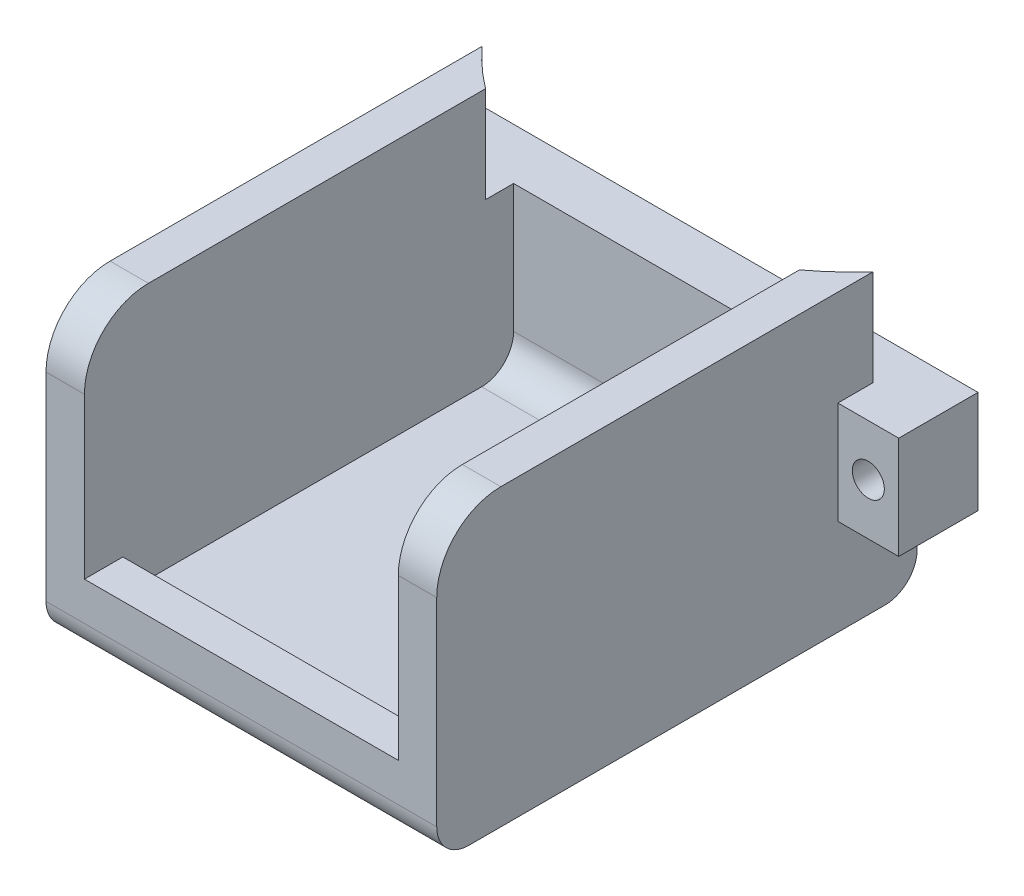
ISO-10303-21;
HEADER;
FILE_DESCRIPTION(('STEP AP214'),'2;1');
FILE_NAME('part.step','',(''),(''),'','','');
FILE_SCHEMA(('AUTOMOTIVE_DESIGN { 1 0 10303 214 1 1 1 1 }'));
ENDSEC;
DATA;
#1=APPLICATION_CONTEXT('core data for automotive mechanical design processes');
#2=APPLICATION_PROTOCOL_DEFINITION('international standard','automotive_design',2000,#1);
#3=PRODUCT_CONTEXT('',#1,'mechanical');
#4=PRODUCT('Part','Part','',(#3));
#5=PRODUCT_RELATED_PRODUCT_CATEGORY('part','',(#4));
#6=PRODUCT_DEFINITION_FORMATION('','',#4);
#7=PRODUCT_DEFINITION_CONTEXT('part definition',#1,'design');
#8=PRODUCT_DEFINITION('design','',#6,#7);
#9=PRODUCT_DEFINITION_SHAPE('','',#8);
#10=(LENGTH_UNIT() NAMED_UNIT(*) SI_UNIT(.MILLI.,.METRE.));
#11=(NAMED_UNIT(*) PLANE_ANGLE_UNIT() SI_UNIT($,.RADIAN.));
#12=(NAMED_UNIT(*) SI_UNIT($,.STERADIAN.) SOLID_ANGLE_UNIT());
#13=UNCERTAINTY_MEASURE_WITH_UNIT(LENGTH_MEASURE(1.E-05),#10,'distance_accuracy_value','');
#14=(GEOMETRIC_REPRESENTATION_CONTEXT(3) GLOBAL_UNCERTAINTY_ASSIGNED_CONTEXT((#13)) GLOBAL_UNIT_ASSIGNED_CONTEXT((#10,
#11,#12)) REPRESENTATION_CONTEXT('',''));
#15=CARTESIAN_POINT('',(0.,0.,0.));
#16=DIRECTION('',(0.,0.,1.));
#17=DIRECTION('',(1.,0.,0.));
#18=AXIS2_PLACEMENT_3D('',#15,#16,#17);
#19=CARTESIAN_POINT('',(0.,0.,0.));
#20=DIRECTION('',(0.,1.,0.));
#21=DIRECTION('',(0.,0.,1.));
#22=AXIS2_PLACEMENT_3D('',#19,#20,#21);
#23=PLANE('',#22);
#24=DIRECTION('',(0.,0.,-1.));
#25=VECTOR('',#24,1.);
#26=CARTESIAN_POINT('',(-40.,0.,0.));
#27=LINE('',#26,#25);
#28=CARTESIAN_POINT('',(-40.,0.,32.8747623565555));
#29=VERTEX_POINT('',#28);
#30=CARTESIAN_POINT('',(-40.,0.,20.5));
#31=VERTEX_POINT('',#30);
#32=EDGE_CURVE('E237',#29,#31,#27,.T.);
#33=ORIENTED_EDGE('',*,*,#32,.T.);
#34=DIRECTION('',(1.,0.,0.));
#35=VECTOR('',#34,1.);
#36=CARTESIAN_POINT('',(0.,0.,20.5));
#37=LINE('',#36,#35);
#38=CARTESIAN_POINT('',(-30.5,0.,20.5));
#39=VERTEX_POINT('',#38);
#40=EDGE_CURVE('E49',#31,#39,#37,.T.);
#41=ORIENTED_EDGE('',*,*,#40,.T.);
#42=DIRECTION('',(0.,0.,1.));
#43=VECTOR('',#42,1.);
#44=CARTESIAN_POINT('',(-30.5,0.,0.));
#45=LINE('',#44,#43);
#46=CARTESIAN_POINT('',(-30.5,0.,32.8747623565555));
#47=VERTEX_POINT('',#46);
#48=EDGE_CURVE('E320',#39,#47,#45,.T.);
#49=ORIENTED_EDGE('',*,*,#48,.T.);
#50=DIRECTION('',(-1.,0.,0.));
#51=VECTOR('',#50,1.);
#52=CARTESIAN_POINT('',(-24.5,0.,32.8747623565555));
#53=LINE('',#52,#51);
#54=EDGE_CURVE('E395',#47,#29,#53,.T.);
#55=ORIENTED_EDGE('',*,*,#54,.T.);
#56=EDGE_LOOP('',(#33,#41,#49,#55));
#57=FACE_BOUND('',#56,.T.);
#58=ADVANCED_FACE('F33',(#57),#23,.F.);
#59=CARTESIAN_POINT('',(30.5,31.,95.5));
#60=DIRECTION('',(1.,0.,0.));
#61=DIRECTION('',(0.,0.,-1.));
#62=AXIS2_PLACEMENT_3D('',#59,#60,#61);
#63=PLANE('',#62);
#64=DIRECTION('',(0.,-1.,0.));
#65=VECTOR('',#64,1.);
#66=CARTESIAN_POINT('',(30.5,31.,32.8747623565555));
#67=LINE('',#66,#65);
#68=CARTESIAN_POINT('',(30.5,16.,32.8747623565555));
#69=VERTEX_POINT('',#68);
#70=CARTESIAN_POINT('',(30.5,0.,32.8747623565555));
#71=VERTEX_POINT('',#70);
#72=EDGE_CURVE('E246',#69,#71,#67,.T.);
#73=ORIENTED_EDGE('',*,*,#72,.F.);
#74=DIRECTION('',(0.,0.,-1.));
#75=VECTOR('',#74,1.);
#76=CARTESIAN_POINT('',(30.5,16.,95.5));
#77=LINE('',#76,#75);
#78=CARTESIAN_POINT('',(30.5,16.,27.3998175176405));
#79=VERTEX_POINT('',#78);
#80=EDGE_CURVE('E241',#69,#79,#77,.T.);
#81=ORIENTED_EDGE('',*,*,#80,.T.);
#82=DIRECTION('',(0.,-1.,0.));
#83=VECTOR('',#82,1.);
#84=CARTESIAN_POINT('',(30.5,31.001,27.3998175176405));
#85=LINE('',#84,#83);
#86=CARTESIAN_POINT('',(30.5,31.,27.3998175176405));
#87=VERTEX_POINT('',#86);
#88=EDGE_CURVE('E257',#87,#79,#85,.T.);
#89=ORIENTED_EDGE('',*,*,#88,.F.);
#90=DIRECTION('',(0.,0.,-1.));
#91=VECTOR('',#90,1.);
#92=CARTESIAN_POINT('',(30.5,31.,95.5));
#93=LINE('',#92,#91);
#94=CARTESIAN_POINT('',(30.5,31.,85.5));
#95=VERTEX_POINT('',#94);
#96=EDGE_CURVE('E317',#95,#87,#93,.T.);
#97=ORIENTED_EDGE('',*,*,#96,.F.);
#98=CARTESIAN_POINT('',(30.5,21.,85.5));
#99=DIRECTION('',(1.,0.,0.));
#100=DIRECTION('',(0.,0.,-1.));
#101=AXIS2_PLACEMENT_3D('',#98,#99,#100);
#102=CIRCLE('',#101,10.);
#103=CARTESIAN_POINT('',(30.5,21.,95.5));
#104=VERTEX_POINT('',#103);
#105=EDGE_CURVE('E339',#95,#104,#102,.T.);
#106=ORIENTED_EDGE('',*,*,#105,.T.);
#107=DIRECTION('',(0.,-1.,0.));
#108=VECTOR('',#107,1.);
#109=CARTESIAN_POINT('',(30.5,31.,95.5));
#110=LINE('',#109,#108);
#111=CARTESIAN_POINT('',(30.5,-9.99999999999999,95.5));
#112=VERTEX_POINT('',#111);
#113=EDGE_CURVE('E307',#104,#112,#110,.T.);
#114=ORIENTED_EDGE('',*,*,#113,.T.);
#115=CARTESIAN_POINT('',(30.5,-10.,90.5));
#116=DIRECTION('',(1.,0.,0.));
#117=DIRECTION('',(0.,0.,-1.));
#118=AXIS2_PLACEMENT_3D('',#115,#116,#117);
#119=CIRCLE('',#118,5.);
#120=CARTESIAN_POINT('',(30.5,-15.,90.5));
#121=VERTEX_POINT('',#120);
#122=EDGE_CURVE('E379',#112,#121,#119,.T.);
#123=ORIENTED_EDGE('',*,*,#122,.T.);
#124=DIRECTION('',(0.,0.,-1.));
#125=VECTOR('',#124,1.);
#126=CARTESIAN_POINT('',(30.5,-15.,95.5));
#127=LINE('',#126,#125);
#128=CARTESIAN_POINT('',(30.5,-15.,25.5));
#129=VERTEX_POINT('',#128);
#130=EDGE_CURVE('E313',#121,#129,#127,.T.);
#131=ORIENTED_EDGE('',*,*,#130,.T.);
#132=CARTESIAN_POINT('',(30.5,-10.,25.5));
#133=DIRECTION('',(1.,0.,0.));
#134=DIRECTION('',(0.,0.,-1.));
#135=AXIS2_PLACEMENT_3D('',#132,#133,#134);
#136=CIRCLE('',#135,5.);
#137=CARTESIAN_POINT('',(30.5,-9.99999999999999,20.5));
#138=VERTEX_POINT('',#137);
#139=EDGE_CURVE('E377',#129,#138,#136,.T.);
#140=ORIENTED_EDGE('',*,*,#139,.T.);
#141=DIRECTION('',(0.,-1.,0.));
#142=VECTOR('',#141,1.);
#143=CARTESIAN_POINT('',(30.5,31.,20.5));
#144=LINE('',#143,#142);
#145=CARTESIAN_POINT('',(30.5,0.,20.5));
#146=VERTEX_POINT('',#145);
#147=EDGE_CURVE('E300',#146,#138,#144,.T.);
#148=ORIENTED_EDGE('',*,*,#147,.F.);
#149=DIRECTION('',(0.,0.,-1.));
#150=VECTOR('',#149,1.);
#151=CARTESIAN_POINT('',(30.5,0.,0.));
#152=LINE('',#151,#150);
#153=EDGE_CURVE('E330',#71,#146,#152,.T.);
#154=ORIENTED_EDGE('',*,*,#153,.F.);
#155=EDGE_LOOP('',(#73,#81,#89,#97,#106,#114,#123,#131,#140,#148,#154));
#156=FACE_BOUND('',#155,.T.);
#157=ADVANCED_FACE('F419',(#156),#63,.T.);
#158=CARTESIAN_POINT('',(-30.5,31.,95.5));
#159=DIRECTION('',(-1.,0.,0.));
#160=DIRECTION('',(0.,0.,1.));
#161=AXIS2_PLACEMENT_3D('',#158,#159,#160);
#162=PLANE('',#161);
#163=DIRECTION('',(0.,-1.,0.));
#164=VECTOR('',#163,1.);
#165=CARTESIAN_POINT('',(-30.5,31.001,27.3998175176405));
#166=LINE('',#165,#164);
#167=CARTESIAN_POINT('',(-30.5,16.,27.3998175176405));
#168=VERTEX_POINT('',#167);
#169=CARTESIAN_POINT('',(-30.5,31.,27.3998175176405));
#170=VERTEX_POINT('',#169);
#171=EDGE_CURVE('E255',#168,#170,#166,.F.);
#172=ORIENTED_EDGE('',*,*,#171,.F.);
#173=DIRECTION('',(0.,0.,1.));
#174=VECTOR('',#173,1.);
#175=CARTESIAN_POINT('',(-30.5,16.,95.5));
#176=LINE('',#175,#174);
#177=CARTESIAN_POINT('',(-30.5,16.,32.8747623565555));
#178=VERTEX_POINT('',#177);
#179=EDGE_CURVE('E239',#168,#178,#176,.T.);
#180=ORIENTED_EDGE('',*,*,#179,.T.);
#181=DIRECTION('',(0.,1.,0.));
#182=VECTOR('',#181,1.);
#183=CARTESIAN_POINT('',(-30.5,31.,32.8747623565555));
#184=LINE('',#183,#182);
#185=EDGE_CURVE('E243',#47,#178,#184,.T.);
#186=ORIENTED_EDGE('',*,*,#185,.F.);
#187=ORIENTED_EDGE('',*,*,#48,.F.);
#188=DIRECTION('',(0.,1.,0.));
#189=VECTOR('',#188,1.);
#190=CARTESIAN_POINT('',(-30.5,31.,20.5));
#191=LINE('',#190,#189);
#192=CARTESIAN_POINT('',(-30.5,-9.99999999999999,20.5));
#193=VERTEX_POINT('',#192);
#194=EDGE_CURVE('E311',#193,#39,#191,.T.);
#195=ORIENTED_EDGE('',*,*,#194,.F.);
#196=CARTESIAN_POINT('',(-30.5,-10.,25.5));
#197=DIRECTION('',(-1.,0.,0.));
#198=DIRECTION('',(0.,0.,1.));
#199=AXIS2_PLACEMENT_3D('',#196,#197,#198);
#200=CIRCLE('',#199,5.);
#201=CARTESIAN_POINT('',(-30.5,-15.,25.5));
#202=VERTEX_POINT('',#201);
#203=EDGE_CURVE('E371',#193,#202,#200,.T.);
#204=ORIENTED_EDGE('',*,*,#203,.T.);
#205=DIRECTION('',(0.,0.,-1.));
#206=VECTOR('',#205,1.);
#207=CARTESIAN_POINT('',(-30.5,-15.,95.5));
#208=LINE('',#207,#206);
#209=CARTESIAN_POINT('',(-30.5,-15.,90.5));
#210=VERTEX_POINT('',#209);
#211=EDGE_CURVE('E324',#210,#202,#208,.T.);
#212=ORIENTED_EDGE('',*,*,#211,.F.);
#213=CARTESIAN_POINT('',(-30.5,-10.,90.5));
#214=DIRECTION('',(-1.,0.,0.));
#215=DIRECTION('',(0.,0.,1.));
#216=AXIS2_PLACEMENT_3D('',#213,#214,#215);
#217=CIRCLE('',#216,5.);
#218=CARTESIAN_POINT('',(-30.5,-9.99999999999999,95.5));
#219=VERTEX_POINT('',#218);
#220=EDGE_CURVE('E373',#210,#219,#217,.T.);
#221=ORIENTED_EDGE('',*,*,#220,.T.);
#222=DIRECTION('',(0.,1.,0.));
#223=VECTOR('',#222,1.);
#224=CARTESIAN_POINT('',(-30.5,31.,95.5));
#225=LINE('',#224,#223);
#226=CARTESIAN_POINT('',(-30.5,21.,95.5));
#227=VERTEX_POINT('',#226);
#228=EDGE_CURVE('E310',#219,#227,#225,.T.);
#229=ORIENTED_EDGE('',*,*,#228,.T.);
#230=CARTESIAN_POINT('',(-30.5,21.,85.5));
#231=DIRECTION('',(-1.,0.,0.));
#232=DIRECTION('',(0.,0.,1.));
#233=AXIS2_PLACEMENT_3D('',#230,#231,#232);
#234=CIRCLE('',#233,10.);
#235=CARTESIAN_POINT('',(-30.5,31.,85.5));
#236=VERTEX_POINT('',#235);
#237=EDGE_CURVE('E350',#227,#236,#234,.T.);
#238=ORIENTED_EDGE('',*,*,#237,.T.);
#239=DIRECTION('',(0.,0.,-1.));
#240=VECTOR('',#239,1.);
#241=CARTESIAN_POINT('',(-30.5,31.,95.5));
#242=LINE('',#241,#240);
#243=EDGE_CURVE('E321',#236,#170,#242,.T.);
#244=ORIENTED_EDGE('',*,*,#243,.T.);
#245=EDGE_LOOP('',(#172,#180,#186,#187,#195,#204,#212,#221,#229,#238,#244));
#246=FACE_BOUND('',#245,.T.);
#247=ADVANCED_FACE('F390',(#246),#162,.T.);
#248=CARTESIAN_POINT('',(20.5,0.,20.5));
#249=DIRECTION('',(0.,0.,1.));
#250=DIRECTION('',(1.,0.,0.));
#251=AXIS2_PLACEMENT_3D('',#248,#249,#250);
#252=PLANE('',#251);
#253=ORIENTED_EDGE('',*,*,#194,.T.);
#254=ORIENTED_EDGE('',*,*,#40,.F.);
#255=DIRECTION('',(0.,-1.,0.));
#256=VECTOR('',#255,1.);
#257=CARTESIAN_POINT('',(-40.,31.,20.5));
#258=LINE('',#257,#256);
#259=CARTESIAN_POINT('',(-40.,16.,20.5));
#260=VERTEX_POINT('',#259);
#261=EDGE_CURVE('E208',#260,#31,#258,.T.);
#262=ORIENTED_EDGE('',*,*,#261,.F.);
#263=DIRECTION('',(1.,0.,0.));
#264=VECTOR('',#263,1.);
#265=CARTESIAN_POINT('',(0.,16.,20.5));
#266=LINE('',#265,#264);
#267=CARTESIAN_POINT('',(40.,16.,20.5));
#268=VERTEX_POINT('',#267);
#269=EDGE_CURVE('E55',#260,#268,#266,.T.);
#270=ORIENTED_EDGE('',*,*,#269,.T.);
#271=DIRECTION('',(0.,-1.,0.));
#272=VECTOR('',#271,1.);
#273=CARTESIAN_POINT('',(40.,31.,20.5));
#274=LINE('',#273,#272);
#275=CARTESIAN_POINT('',(40.,0.,20.5));
#276=VERTEX_POINT('',#275);
#277=EDGE_CURVE('E214',#268,#276,#274,.T.);
#278=ORIENTED_EDGE('',*,*,#277,.T.);
#279=EDGE_CURVE('E396',#146,#276,#37,.T.);
#280=ORIENTED_EDGE('',*,*,#279,.F.);
#281=ORIENTED_EDGE('',*,*,#147,.T.);
#282=DIRECTION('',(-1.,0.,0.));
#283=VECTOR('',#282,1.);
#284=CARTESIAN_POINT('',(-30.5,-10.,20.5));
#285=LINE('',#284,#283);
#286=EDGE_CURVE('E42',#138,#193,#285,.T.);
#287=ORIENTED_EDGE('',*,*,#286,.T.);
#288=EDGE_LOOP('',(#253,#254,#262,#270,#278,#280,#281,#287));
#289=FACE_BOUND('',#288,.T.);
#290=CARTESIAN_POINT('',(-35.25,8.,20.5));
#291=DIRECTION('',(0.,0.,1.));
#292=DIRECTION('',(1.,0.,0.));
#293=AXIS2_PLACEMENT_3D('',#290,#291,#292);
#294=CIRCLE('',#293,2.49999999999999);
#295=CARTESIAN_POINT('',(-32.75,8.,20.5));
#296=VERTEX_POINT('',#295);
#297=EDGE_CURVE('E37',#296,#296,#294,.F.);
#298=ORIENTED_EDGE('',*,*,#297,.F.);
#299=EDGE_LOOP('',(#298));
#300=FACE_BOUND('',#299,.T.);
#301=CARTESIAN_POINT('',(35.25,8.,20.5));
#302=DIRECTION('',(0.,0.,1.));
#303=DIRECTION('',(1.,0.,0.));
#304=AXIS2_PLACEMENT_3D('',#301,#302,#303);
#305=CIRCLE('',#304,2.49999999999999);
#306=CARTESIAN_POINT('',(37.75,8.,20.5));
#307=VERTEX_POINT('',#306);
#308=EDGE_CURVE('E401',#307,#307,#305,.F.);
#309=ORIENTED_EDGE('',*,*,#308,.F.);
#310=EDGE_LOOP('',(#309));
#311=FACE_BOUND('',#310,.T.);
#312=ADVANCED_FACE('F209',(#289,#300,#311),#252,.F.);
#313=CARTESIAN_POINT('',(30.5,31.,95.5));
#314=DIRECTION('',(0.,1.,0.));
#315=DIRECTION('',(0.,0.,1.));
#316=AXIS2_PLACEMENT_3D('',#313,#314,#315);
#317=PLANE('',#316);
#318=ORIENTED_EDGE('',*,*,#96,.T.);
#319=CARTESIAN_POINT('',(0.,31.,0.));
#320=DIRECTION('',(0.,1.,0.));
#321=DIRECTION('',(0.,0.,1.));
#322=AXIS2_PLACEMENT_3D('',#319,#320,#321);
#323=CIRCLE('',#322,41.);
#324=CARTESIAN_POINT('',(24.5,31.,32.8747623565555));
#325=VERTEX_POINT('',#324);
#326=EDGE_CURVE('E273',#325,#87,#323,.T.);
#327=ORIENTED_EDGE('',*,*,#326,.F.);
#328=DIRECTION('',(0.,0.,-1.));
#329=VECTOR('',#328,1.);
#330=CARTESIAN_POINT('',(24.5,31.,95.5));
#331=LINE('',#330,#329);
#332=CARTESIAN_POINT('',(24.5,31.,85.5));
#333=VERTEX_POINT('',#332);
#334=EDGE_CURVE('E281',#333,#325,#331,.T.);
#335=ORIENTED_EDGE('',*,*,#334,.F.);
#336=DIRECTION('',(1.,0.,0.));
#337=VECTOR('',#336,1.);
#338=CARTESIAN_POINT('',(30.5,31.,85.5));
#339=LINE('',#338,#337);
#340=EDGE_CURVE('E336',#333,#95,#339,.T.);
#341=ORIENTED_EDGE('',*,*,#340,.T.);
#342=EDGE_LOOP('',(#318,#327,#335,#341));
#343=FACE_BOUND('',#342,.T.);
#344=ADVANCED_FACE('F448',(#343),#317,.T.);
#345=DIRECTION('',(0.,0.,1.));
#346=VECTOR('',#345,1.);
#347=CARTESIAN_POINT('',(-24.5,31.,95.5));
#348=LINE('',#347,#346);
#349=CARTESIAN_POINT('',(-24.5,31.,32.8747623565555));
#350=VERTEX_POINT('',#349);
#351=CARTESIAN_POINT('',(-24.5,31.,85.5));
#352=VERTEX_POINT('',#351);
#353=EDGE_CURVE('E288',#350,#352,#348,.T.);
#354=ORIENTED_EDGE('',*,*,#353,.F.);
#355=EDGE_CURVE('E205',#170,#350,#323,.T.);
#356=ORIENTED_EDGE('',*,*,#355,.F.);
#357=ORIENTED_EDGE('',*,*,#243,.F.);
#358=DIRECTION('',(1.,0.,0.));
#359=VECTOR('',#358,1.);
#360=CARTESIAN_POINT('',(-24.5,31.,85.5));
#361=LINE('',#360,#359);
#362=EDGE_CURVE('E333',#236,#352,#361,.T.);
#363=ORIENTED_EDGE('',*,*,#362,.T.);
#364=EDGE_LOOP('',(#354,#356,#357,#363));
#365=FACE_BOUND('',#364,.T.);
#366=ADVANCED_FACE('F485',(#365),#317,.T.);
#367=CARTESIAN_POINT('',(24.5,-4.,95.5));
#368=DIRECTION('',(1.,0.,0.));
#369=DIRECTION('',(0.,0.,-1.));
#370=AXIS2_PLACEMENT_3D('',#367,#368,#369);
#371=PLANE('',#370);
#372=DIRECTION('',(0.,-1.,0.));
#373=VECTOR('',#372,1.);
#374=CARTESIAN_POINT('',(24.5,31.001,32.8747623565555));
#375=LINE('',#374,#373);
#376=CARTESIAN_POINT('',(24.5,16.,32.8747623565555));
#377=VERTEX_POINT('',#376);
#378=EDGE_CURVE('E252',#325,#377,#375,.T.);
#379=ORIENTED_EDGE('',*,*,#378,.T.);
#380=DIRECTION('',(0.,0.,-1.));
#381=VECTOR('',#380,1.);
#382=CARTESIAN_POINT('',(24.5,16.,0.));
#383=LINE('',#382,#381);
#384=CARTESIAN_POINT('',(24.5,16.,28.5));
#385=VERTEX_POINT('',#384);
#386=EDGE_CURVE('E206',#377,#385,#383,.T.);
#387=ORIENTED_EDGE('',*,*,#386,.T.);
#388=DIRECTION('',(0.,1.,0.));
#389=VECTOR('',#388,1.);
#390=CARTESIAN_POINT('',(24.5,-4.,28.5));
#391=LINE('',#390,#389);
#392=CARTESIAN_POINT('',(24.5,-4.,28.5));
#393=VERTEX_POINT('',#392);
#394=EDGE_CURVE('E293',#393,#385,#391,.T.);
#395=ORIENTED_EDGE('',*,*,#394,.F.);
#396=CARTESIAN_POINT('',(24.5,-4.,33.5));
#397=DIRECTION('',(1.,0.,0.));
#398=DIRECTION('',(0.,0.,-1.));
#399=AXIS2_PLACEMENT_3D('',#396,#397,#398);
#400=CIRCLE('',#399,5.);
#401=CARTESIAN_POINT('',(24.5,-9.00000000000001,33.5));
#402=VERTEX_POINT('',#401);
#403=EDGE_CURVE('E358',#393,#402,#400,.F.);
#404=ORIENTED_EDGE('',*,*,#403,.T.);
#405=DIRECTION('',(0.,0.,-1.));
#406=VECTOR('',#405,1.);
#407=CARTESIAN_POINT('',(24.5,-9.00000000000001,28.5));
#408=LINE('',#407,#406);
#409=CARTESIAN_POINT('',(24.5,-9.00000000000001,84.5));
#410=VERTEX_POINT('',#409);
#411=EDGE_CURVE('E277',#410,#402,#408,.T.);
#412=ORIENTED_EDGE('',*,*,#411,.F.);
#413=CARTESIAN_POINT('',(24.5,-4.,84.5));
#414=DIRECTION('',(1.,0.,0.));
#415=DIRECTION('',(0.,0.,-1.));
#416=AXIS2_PLACEMENT_3D('',#413,#414,#415);
#417=CIRCLE('',#416,5.);
#418=CARTESIAN_POINT('',(24.5,-4.,89.5));
#419=VERTEX_POINT('',#418);
#420=EDGE_CURVE('E360',#410,#419,#417,.F.);
#421=ORIENTED_EDGE('',*,*,#420,.T.);
#422=DIRECTION('',(0.,0.,-1.));
#423=VECTOR('',#422,1.);
#424=CARTESIAN_POINT('',(24.5,-4.,95.5));
#425=LINE('',#424,#423);
#426=CARTESIAN_POINT('',(24.5,-4.,95.5));
#427=VERTEX_POINT('',#426);
#428=EDGE_CURVE('E284',#427,#419,#425,.T.);
#429=ORIENTED_EDGE('',*,*,#428,.F.);
#430=DIRECTION('',(0.,1.,0.));
#431=VECTOR('',#430,1.);
#432=CARTESIAN_POINT('',(24.5,-4.,95.5));
#433=LINE('',#432,#431);
#434=CARTESIAN_POINT('',(24.5,21.,95.5));
#435=VERTEX_POINT('',#434);
#436=EDGE_CURVE('E297',#427,#435,#433,.T.);
#437=ORIENTED_EDGE('',*,*,#436,.T.);
#438=CARTESIAN_POINT('',(24.5,21.,85.5));
#439=DIRECTION('',(1.,0.,0.));
#440=DIRECTION('',(0.,0.,-1.));
#441=AXIS2_PLACEMENT_3D('',#438,#439,#440);
#442=CIRCLE('',#441,10.);
#443=EDGE_CURVE('E346',#435,#333,#442,.F.);
#444=ORIENTED_EDGE('',*,*,#443,.T.);
#445=ORIENTED_EDGE('',*,*,#334,.T.);
#446=EDGE_LOOP('',(#379,#387,#395,#404,#412,#421,#429,#437,#444,#445));
#447=FACE_BOUND('',#446,.T.);
#448=ADVANCED_FACE('F445',(#447),#371,.F.);
#449=CARTESIAN_POINT('',(-24.5,-4.,95.5));
#450=DIRECTION('',(-1.,0.,0.));
#451=DIRECTION('',(0.,0.,1.));
#452=AXIS2_PLACEMENT_3D('',#449,#450,#451);
#453=PLANE('',#452);
#454=DIRECTION('',(0.,0.,1.));
#455=VECTOR('',#454,1.);
#456=CARTESIAN_POINT('',(-24.5,16.,0.));
#457=LINE('',#456,#455);
#458=CARTESIAN_POINT('',(-24.5,16.,28.5));
#459=VERTEX_POINT('',#458);
#460=CARTESIAN_POINT('',(-24.5,16.,32.8747623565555));
#461=VERTEX_POINT('',#460);
#462=EDGE_CURVE('E267',#459,#461,#457,.T.);
#463=ORIENTED_EDGE('',*,*,#462,.T.);
#464=DIRECTION('',(0.,-1.,0.));
#465=VECTOR('',#464,1.);
#466=CARTESIAN_POINT('',(-24.5,31.001,32.8747623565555));
#467=LINE('',#466,#465);
#468=EDGE_CURVE('E249',#461,#350,#467,.F.);
#469=ORIENTED_EDGE('',*,*,#468,.T.);
#470=ORIENTED_EDGE('',*,*,#353,.T.);
#471=CARTESIAN_POINT('',(-24.5,21.,85.5));
#472=DIRECTION('',(-1.,0.,0.));
#473=DIRECTION('',(0.,0.,1.));
#474=AXIS2_PLACEMENT_3D('',#471,#472,#473);
#475=CIRCLE('',#474,10.);
#476=CARTESIAN_POINT('',(-24.5,21.,95.5));
#477=VERTEX_POINT('',#476);
#478=EDGE_CURVE('E348',#352,#477,#475,.F.);
#479=ORIENTED_EDGE('',*,*,#478,.T.);
#480=DIRECTION('',(0.,1.,0.));
#481=VECTOR('',#480,1.);
#482=CARTESIAN_POINT('',(-24.5,-4.,95.5));
#483=LINE('',#482,#481);
#484=CARTESIAN_POINT('',(-24.5,-4.,95.5));
#485=VERTEX_POINT('',#484);
#486=EDGE_CURVE('E301',#485,#477,#483,.T.);
#487=ORIENTED_EDGE('',*,*,#486,.F.);
#488=DIRECTION('',(0.,0.,1.));
#489=VECTOR('',#488,1.);
#490=CARTESIAN_POINT('',(-24.5,-4.,95.5));
#491=LINE('',#490,#489);
#492=CARTESIAN_POINT('',(-24.5,-4.,89.5));
#493=VERTEX_POINT('',#492);
#494=EDGE_CURVE('E287',#493,#485,#491,.T.);
#495=ORIENTED_EDGE('',*,*,#494,.F.);
#496=CARTESIAN_POINT('',(-24.5,-4.,84.5));
#497=DIRECTION('',(-1.,0.,0.));
#498=DIRECTION('',(0.,0.,1.));
#499=AXIS2_PLACEMENT_3D('',#496,#497,#498);
#500=CIRCLE('',#499,5.);
#501=CARTESIAN_POINT('',(-24.5,-9.00000000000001,84.5));
#502=VERTEX_POINT('',#501);
#503=EDGE_CURVE('E364',#493,#502,#500,.F.);
#504=ORIENTED_EDGE('',*,*,#503,.T.);
#505=DIRECTION('',(0.,0.,1.));
#506=VECTOR('',#505,1.);
#507=CARTESIAN_POINT('',(-24.5,-9.00000000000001,28.5));
#508=LINE('',#507,#506);
#509=CARTESIAN_POINT('',(-24.5,-9.00000000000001,33.5));
#510=VERTEX_POINT('',#509);
#511=EDGE_CURVE('E274',#510,#502,#508,.T.);
#512=ORIENTED_EDGE('',*,*,#511,.F.);
#513=CARTESIAN_POINT('',(-24.5,-4.,33.5));
#514=DIRECTION('',(-1.,0.,0.));
#515=DIRECTION('',(0.,0.,1.));
#516=AXIS2_PLACEMENT_3D('',#513,#514,#515);
#517=CIRCLE('',#516,5.);
#518=CARTESIAN_POINT('',(-24.5,-4.,28.5));
#519=VERTEX_POINT('',#518);
#520=EDGE_CURVE('E362',#510,#519,#517,.F.);
#521=ORIENTED_EDGE('',*,*,#520,.T.);
#522=DIRECTION('',(0.,1.,0.));
#523=VECTOR('',#522,1.);
#524=CARTESIAN_POINT('',(-24.5,-4.,28.5));
#525=LINE('',#524,#523);
#526=EDGE_CURVE('E304',#519,#459,#525,.T.);
#527=ORIENTED_EDGE('',*,*,#526,.T.);
#528=EDGE_LOOP('',(#463,#469,#470,#479,#487,#495,#504,#512,#521,#527));
#529=FACE_BOUND('',#528,.T.);
#530=ADVANCED_FACE('F467',(#529),#453,.F.);
#531=CARTESIAN_POINT('',(24.5,-4.,28.5));
#532=DIRECTION('',(0.,0.,-1.));
#533=DIRECTION('',(-1.,0.,0.));
#534=AXIS2_PLACEMENT_3D('',#531,#532,#533);
#535=PLANE('',#534);
#536=DIRECTION('',(-1.,0.,0.));
#537=VECTOR('',#536,1.);
#538=CARTESIAN_POINT('',(0.,16.,28.5));
#539=LINE('',#538,#537);
#540=EDGE_CURVE('E264',#385,#459,#539,.T.);
#541=ORIENTED_EDGE('',*,*,#540,.T.);
#542=ORIENTED_EDGE('',*,*,#526,.F.);
#543=DIRECTION('',(-1.,0.,0.));
#544=VECTOR('',#543,1.);
#545=CARTESIAN_POINT('',(24.5,-4.,28.5));
#546=LINE('',#545,#544);
#547=EDGE_CURVE('E11',#519,#393,#546,.F.);
#548=ORIENTED_EDGE('',*,*,#547,.T.);
#549=ORIENTED_EDGE('',*,*,#394,.T.);
#550=EDGE_LOOP('',(#541,#542,#548,#549));
#551=FACE_BOUND('',#550,.T.);
#552=ADVANCED_FACE('F491',(#551),#535,.F.);
#553=CARTESIAN_POINT('',(0.,16.,0.));
#554=DIRECTION('',(0.,1.,0.));
#555=DIRECTION('',(0.,0.,1.));
#556=AXIS2_PLACEMENT_3D('',#553,#554,#555);
#557=PLANE('',#556);
#558=ORIENTED_EDGE('',*,*,#269,.F.);
#559=DIRECTION('',(0.,0.,1.));
#560=VECTOR('',#559,1.);
#561=CARTESIAN_POINT('',(-40.,16.,0.));
#562=LINE('',#561,#560);
#563=CARTESIAN_POINT('',(-40.,16.,32.8747623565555));
#564=VERTEX_POINT('',#563);
#565=EDGE_CURVE('E201',#260,#564,#562,.T.);
#566=ORIENTED_EDGE('',*,*,#565,.T.);
#567=DIRECTION('',(1.,0.,0.));
#568=VECTOR('',#567,1.);
#569=CARTESIAN_POINT('',(-24.5,16.,32.8747623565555));
#570=LINE('',#569,#568);
#571=EDGE_CURVE('E220',#564,#178,#570,.T.);
#572=ORIENTED_EDGE('',*,*,#571,.T.);
#573=ORIENTED_EDGE('',*,*,#179,.F.);
#574=CARTESIAN_POINT('',(0.,16.,0.));
#575=DIRECTION('',(0.,1.,0.));
#576=DIRECTION('',(0.,0.,1.));
#577=AXIS2_PLACEMENT_3D('',#574,#575,#576);
#578=CIRCLE('',#577,41.);
#579=EDGE_CURVE('E260',#168,#461,#578,.T.);
#580=ORIENTED_EDGE('',*,*,#579,.T.);
#581=ORIENTED_EDGE('',*,*,#462,.F.);
#582=ORIENTED_EDGE('',*,*,#540,.F.);
#583=ORIENTED_EDGE('',*,*,#386,.F.);
#584=EDGE_CURVE('E261',#377,#79,#578,.T.);
#585=ORIENTED_EDGE('',*,*,#584,.T.);
#586=ORIENTED_EDGE('',*,*,#80,.F.);
#587=DIRECTION('',(1.,0.,0.));
#588=VECTOR('',#587,1.);
#589=CARTESIAN_POINT('',(40.,16.,32.8747623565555));
#590=LINE('',#589,#588);
#591=CARTESIAN_POINT('',(40.,16.,32.8747623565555));
#592=VERTEX_POINT('',#591);
#593=EDGE_CURVE('E223',#69,#592,#590,.T.);
#594=ORIENTED_EDGE('',*,*,#593,.T.);
#595=DIRECTION('',(0.,0.,-1.));
#596=VECTOR('',#595,1.);
#597=CARTESIAN_POINT('',(40.,16.,0.));
#598=LINE('',#597,#596);
#599=EDGE_CURVE('E204',#592,#268,#598,.T.);
#600=ORIENTED_EDGE('',*,*,#599,.T.);
#601=EDGE_LOOP('',(#558,#566,#572,#573,#580,#581,#582,#583,#585,#586,#594,#600));
#602=FACE_BOUND('',#601,.T.);
#603=ADVANCED_FACE('F198',(#602),#557,.T.);
#604=ORIENTED_EDGE('',*,*,#153,.T.);
#605=ORIENTED_EDGE('',*,*,#279,.T.);
#606=DIRECTION('',(0.,0.,1.));
#607=VECTOR('',#606,1.);
#608=CARTESIAN_POINT('',(40.,0.,0.));
#609=LINE('',#608,#607);
#610=CARTESIAN_POINT('',(40.,0.,32.8747623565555));
#611=VERTEX_POINT('',#610);
#612=EDGE_CURVE('E229',#276,#611,#609,.T.);
#613=ORIENTED_EDGE('',*,*,#612,.T.);
#614=DIRECTION('',(-1.,0.,0.));
#615=VECTOR('',#614,1.);
#616=CARTESIAN_POINT('',(40.,0.,32.8747623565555));
#617=LINE('',#616,#615);
#618=EDGE_CURVE('E405',#611,#71,#617,.T.);
#619=ORIENTED_EDGE('',*,*,#618,.T.);
#620=EDGE_LOOP('',(#604,#605,#613,#619));
#621=FACE_BOUND('',#620,.T.);
#622=ADVANCED_FACE('F410',(#621),#23,.F.);
#623=CARTESIAN_POINT('',(30.5,-15.,95.5));
#624=DIRECTION('',(0.,-1.,0.));
#625=DIRECTION('',(0.,0.,-1.));
#626=AXIS2_PLACEMENT_3D('',#623,#624,#625);
#627=PLANE('',#626);
#628=ORIENTED_EDGE('',*,*,#130,.F.);
#629=DIRECTION('',(-1.,0.,0.));
#630=VECTOR('',#629,1.);
#631=CARTESIAN_POINT('',(-30.5,-15.,90.5));
#632=LINE('',#631,#630);
#633=EDGE_CURVE('E368',#121,#210,#632,.T.);
#634=ORIENTED_EDGE('',*,*,#633,.T.);
#635=ORIENTED_EDGE('',*,*,#211,.T.);
#636=DIRECTION('',(-1.,0.,0.));
#637=VECTOR('',#636,1.);
#638=CARTESIAN_POINT('',(30.5,-15.,25.5));
#639=LINE('',#638,#637);
#640=EDGE_CURVE('E366',#202,#129,#639,.F.);
#641=ORIENTED_EDGE('',*,*,#640,.T.);
#642=EDGE_LOOP('',(#628,#634,#635,#641));
#643=FACE_BOUND('',#642,.T.);
#644=ADVANCED_FACE('F424',(#643),#627,.T.);
#645=CARTESIAN_POINT('',(0.,0.,95.5));
#646=DIRECTION('',(0.,0.,-1.));
#647=DIRECTION('',(-1.,0.,0.));
#648=AXIS2_PLACEMENT_3D('',#645,#646,#647);
#649=PLANE('',#648);
#650=ORIENTED_EDGE('',*,*,#228,.F.);
#651=DIRECTION('',(-1.,0.,0.));
#652=VECTOR('',#651,1.);
#653=CARTESIAN_POINT('',(30.5,-10.,95.5));
#654=LINE('',#653,#652);
#655=EDGE_CURVE('E375',#219,#112,#654,.F.);
#656=ORIENTED_EDGE('',*,*,#655,.T.);
#657=ORIENTED_EDGE('',*,*,#113,.F.);
#658=DIRECTION('',(1.,0.,0.));
#659=VECTOR('',#658,1.);
#660=CARTESIAN_POINT('',(24.5,21.,95.5));
#661=LINE('',#660,#659);
#662=EDGE_CURVE('E344',#104,#435,#661,.F.);
#663=ORIENTED_EDGE('',*,*,#662,.T.);
#664=ORIENTED_EDGE('',*,*,#436,.F.);
#665=DIRECTION('',(1.,0.,0.));
#666=VECTOR('',#665,1.);
#667=CARTESIAN_POINT('',(24.5,-4.,95.5));
#668=LINE('',#667,#666);
#669=EDGE_CURVE('E290',#485,#427,#668,.T.);
#670=ORIENTED_EDGE('',*,*,#669,.F.);
#671=ORIENTED_EDGE('',*,*,#486,.T.);
#672=DIRECTION('',(1.,0.,0.));
#673=VECTOR('',#672,1.);
#674=CARTESIAN_POINT('',(-30.5,21.,95.5));
#675=LINE('',#674,#673);
#676=EDGE_CURVE('E341',#477,#227,#675,.F.);
#677=ORIENTED_EDGE('',*,*,#676,.T.);
#678=EDGE_LOOP('',(#650,#656,#657,#663,#664,#670,#671,#677));
#679=FACE_BOUND('',#678,.T.);
#680=ADVANCED_FACE('F430',(#679),#649,.F.);
#681=CARTESIAN_POINT('',(0.,-4.,0.));
#682=DIRECTION('',(0.,1.,0.));
#683=DIRECTION('',(0.,0.,1.));
#684=AXIS2_PLACEMENT_3D('',#681,#682,#683);
#685=PLANE('',#684);
#686=DIRECTION('',(1.,0.,0.));
#687=VECTOR('',#686,1.);
#688=CARTESIAN_POINT('',(-24.5,-4.,89.5));
#689=LINE('',#688,#687);
#690=EDGE_CURVE('E278',#493,#419,#689,.T.);
#691=ORIENTED_EDGE('',*,*,#690,.F.);
#692=ORIENTED_EDGE('',*,*,#494,.T.);
#693=ORIENTED_EDGE('',*,*,#669,.T.);
#694=ORIENTED_EDGE('',*,*,#428,.T.);
#695=EDGE_LOOP('',(#691,#692,#693,#694));
#696=FACE_BOUND('',#695,.T.);
#697=ADVANCED_FACE('F475',(#696),#685,.T.);
#698=CARTESIAN_POINT('',(0.,-9.00000000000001,0.));
#699=DIRECTION('',(0.,1.,0.));
#700=DIRECTION('',(0.,0.,1.));
#701=AXIS2_PLACEMENT_3D('',#698,#699,#700);
#702=PLANE('',#701);
#703=ORIENTED_EDGE('',*,*,#511,.T.);
#704=DIRECTION('',(1.,0.,0.));
#705=VECTOR('',#704,1.);
#706=CARTESIAN_POINT('',(0.,-9.00000000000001,84.5));
#707=LINE('',#706,#705);
#708=EDGE_CURVE('E355',#502,#410,#707,.T.);
#709=ORIENTED_EDGE('',*,*,#708,.T.);
#710=ORIENTED_EDGE('',*,*,#411,.T.);
#711=DIRECTION('',(-1.,0.,0.));
#712=VECTOR('',#711,1.);
#713=CARTESIAN_POINT('',(0.,-9.00000000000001,33.5));
#714=LINE('',#713,#712);
#715=EDGE_CURVE('E352',#402,#510,#714,.T.);
#716=ORIENTED_EDGE('',*,*,#715,.T.);
#717=EDGE_LOOP('',(#703,#709,#710,#716));
#718=FACE_BOUND('',#717,.T.);
#719=ADVANCED_FACE('F464',(#718),#702,.T.);
#720=CARTESIAN_POINT('',(30.5,21.,85.5));
#721=DIRECTION('',(-1.,0.,0.));
#722=DIRECTION('',(0.,0.,1.));
#723=AXIS2_PLACEMENT_3D('',#720,#721,#722);
#724=CYLINDRICAL_SURFACE('',#723,10.);
#725=ORIENTED_EDGE('',*,*,#443,.F.);
#726=ORIENTED_EDGE('',*,*,#662,.F.);
#727=ORIENTED_EDGE('',*,*,#105,.F.);
#728=ORIENTED_EDGE('',*,*,#340,.F.);
#729=EDGE_LOOP('',(#725,#726,#727,#728));
#730=FACE_BOUND('',#729,.T.);
#731=ADVANCED_FACE('F441',(#730),#724,.T.);
#732=CARTESIAN_POINT('',(30.5,21.,85.5));
#733=DIRECTION('',(-1.,0.,0.));
#734=DIRECTION('',(0.,0.,1.));
#735=AXIS2_PLACEMENT_3D('',#732,#733,#734);
#736=CYLINDRICAL_SURFACE('',#735,10.);
#737=ORIENTED_EDGE('',*,*,#237,.F.);
#738=ORIENTED_EDGE('',*,*,#676,.F.);
#739=ORIENTED_EDGE('',*,*,#478,.F.);
#740=ORIENTED_EDGE('',*,*,#362,.F.);
#741=EDGE_LOOP('',(#737,#738,#739,#740));
#742=FACE_BOUND('',#741,.T.);
#743=ADVANCED_FACE('F479',(#742),#736,.T.);
#744=CARTESIAN_POINT('',(0.,-4.,84.5));
#745=DIRECTION('',(1.,0.,0.));
#746=DIRECTION('',(0.,0.,-1.));
#747=AXIS2_PLACEMENT_3D('',#744,#745,#746);
#748=CYLINDRICAL_SURFACE('',#747,5.);
#749=ORIENTED_EDGE('',*,*,#503,.F.);
#750=ORIENTED_EDGE('',*,*,#690,.T.);
#751=ORIENTED_EDGE('',*,*,#420,.F.);
#752=ORIENTED_EDGE('',*,*,#708,.F.);
#753=EDGE_LOOP('',(#749,#750,#751,#752));
#754=FACE_BOUND('',#753,.T.);
#755=ADVANCED_FACE('F473',(#754),#748,.F.);
#756=CARTESIAN_POINT('',(30.5,-10.,90.5));
#757=DIRECTION('',(1.,0.,0.));
#758=DIRECTION('',(0.,0.,-1.));
#759=AXIS2_PLACEMENT_3D('',#756,#757,#758);
#760=CYLINDRICAL_SURFACE('',#759,5.);
#761=ORIENTED_EDGE('',*,*,#122,.F.);
#762=ORIENTED_EDGE('',*,*,#655,.F.);
#763=ORIENTED_EDGE('',*,*,#220,.F.);
#764=ORIENTED_EDGE('',*,*,#633,.F.);
#765=EDGE_LOOP('',(#761,#762,#763,#764));
#766=FACE_BOUND('',#765,.T.);
#767=ADVANCED_FACE('F435',(#766),#760,.T.);
#768=CARTESIAN_POINT('',(20.5,-10.,25.5));
#769=DIRECTION('',(1.,0.,0.));
#770=DIRECTION('',(0.,0.,-1.));
#771=AXIS2_PLACEMENT_3D('',#768,#769,#770);
#772=CYLINDRICAL_SURFACE('',#771,5.);
#773=ORIENTED_EDGE('',*,*,#139,.F.);
#774=ORIENTED_EDGE('',*,*,#640,.F.);
#775=ORIENTED_EDGE('',*,*,#203,.F.);
#776=ORIENTED_EDGE('',*,*,#286,.F.);
#777=EDGE_LOOP('',(#773,#774,#775,#776));
#778=FACE_BOUND('',#777,.T.);
#779=ADVANCED_FACE('F422',(#778),#772,.T.);
#780=CARTESIAN_POINT('',(0.,-4.,33.5));
#781=DIRECTION('',(-1.,0.,0.));
#782=DIRECTION('',(0.,0.,1.));
#783=AXIS2_PLACEMENT_3D('',#780,#781,#782);
#784=CYLINDRICAL_SURFACE('',#783,5.);
#785=ORIENTED_EDGE('',*,*,#403,.F.);
#786=ORIENTED_EDGE('',*,*,#547,.F.);
#787=ORIENTED_EDGE('',*,*,#520,.F.);
#788=ORIENTED_EDGE('',*,*,#715,.F.);
#789=EDGE_LOOP('',(#785,#786,#787,#788));
#790=FACE_BOUND('',#789,.T.);
#791=ADVANCED_FACE('F35',(#790),#784,.F.);
#792=CARTESIAN_POINT('',(0.,31.001,0.));
#793=DIRECTION('',(0.,-1.,0.));
#794=DIRECTION('',(0.,0.,-1.));
#795=AXIS2_PLACEMENT_3D('',#792,#793,#794);
#796=CYLINDRICAL_SURFACE('',#795,41.);
#797=ORIENTED_EDGE('',*,*,#88,.T.);
#798=ORIENTED_EDGE('',*,*,#584,.F.);
#799=ORIENTED_EDGE('',*,*,#378,.F.);
#800=ORIENTED_EDGE('',*,*,#326,.T.);
#801=EDGE_LOOP('',(#797,#798,#799,#800));
#802=FACE_BOUND('',#801,.T.);
#803=ADVANCED_FACE('F451',(#802),#796,.F.);
#804=ORIENTED_EDGE('',*,*,#171,.T.);
#805=ORIENTED_EDGE('',*,*,#355,.T.);
#806=ORIENTED_EDGE('',*,*,#468,.F.);
#807=ORIENTED_EDGE('',*,*,#579,.F.);
#808=EDGE_LOOP('',(#804,#805,#806,#807));
#809=FACE_BOUND('',#808,.T.);
#810=ADVANCED_FACE('F487',(#809),#796,.F.);
#811=CARTESIAN_POINT('',(-40.,-86.4913290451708,0.));
#812=DIRECTION('',(-1.,0.,0.));
#813=DIRECTION('',(0.,0.,1.));
#814=AXIS2_PLACEMENT_3D('',#811,#812,#813);
#815=PLANE('',#814);
#816=ORIENTED_EDGE('',*,*,#261,.T.);
#817=ORIENTED_EDGE('',*,*,#32,.F.);
#818=DIRECTION('',(0.,1.,0.));
#819=VECTOR('',#818,1.);
#820=CARTESIAN_POINT('',(-40.,-86.4913290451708,32.8747623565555));
#821=LINE('',#820,#819);
#822=EDGE_CURVE('E218',#29,#564,#821,.T.);
#823=ORIENTED_EDGE('',*,*,#822,.T.);
#824=ORIENTED_EDGE('',*,*,#565,.F.);
#825=EDGE_LOOP('',(#816,#817,#823,#824));
#826=FACE_BOUND('',#825,.T.);
#827=ADVANCED_FACE('F216',(#826),#815,.T.);
#828=CARTESIAN_POINT('',(-24.5,-86.4913290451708,32.8747623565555));
#829=DIRECTION('',(0.,0.,1.));
#830=DIRECTION('',(1.,0.,0.));
#831=AXIS2_PLACEMENT_3D('',#828,#829,#830);
#832=PLANE('',#831);
#833=CARTESIAN_POINT('',(-35.25,8.,32.8747623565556));
#834=DIRECTION('',(0.,0.,1.));
#835=DIRECTION('',(1.,0.,0.));
#836=AXIS2_PLACEMENT_3D('',#833,#834,#835);
#837=CIRCLE('',#836,2.49999999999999);
#838=CARTESIAN_POINT('',(-32.75,8.,32.8747623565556));
#839=VERTEX_POINT('',#838);
#840=EDGE_CURVE('E226',#839,#839,#837,.T.);
#841=ORIENTED_EDGE('',*,*,#840,.F.);
#842=EDGE_LOOP('',(#841));
#843=FACE_BOUND('',#842,.T.);
#844=ORIENTED_EDGE('',*,*,#54,.F.);
#845=ORIENTED_EDGE('',*,*,#185,.T.);
#846=ORIENTED_EDGE('',*,*,#571,.F.);
#847=ORIENTED_EDGE('',*,*,#822,.F.);
#848=EDGE_LOOP('',(#844,#845,#846,#847));
#849=FACE_BOUND('',#848,.T.);
#850=ADVANCED_FACE('F557',(#843,#849),#832,.T.);
#851=CARTESIAN_POINT('',(40.,-86.4913290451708,0.));
#852=DIRECTION('',(1.,0.,0.));
#853=DIRECTION('',(0.,0.,-1.));
#854=AXIS2_PLACEMENT_3D('',#851,#852,#853);
#855=PLANE('',#854);
#856=ORIENTED_EDGE('',*,*,#277,.F.);
#857=ORIENTED_EDGE('',*,*,#599,.F.);
#858=DIRECTION('',(0.,1.,0.));
#859=VECTOR('',#858,1.);
#860=CARTESIAN_POINT('',(40.,-86.4913290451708,32.8747623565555));
#861=LINE('',#860,#859);
#862=EDGE_CURVE('E234',#611,#592,#861,.T.);
#863=ORIENTED_EDGE('',*,*,#862,.F.);
#864=ORIENTED_EDGE('',*,*,#612,.F.);
#865=EDGE_LOOP('',(#856,#857,#863,#864));
#866=FACE_BOUND('',#865,.T.);
#867=ADVANCED_FACE('F416',(#866),#855,.T.);
#868=CARTESIAN_POINT('',(40.,-86.4913290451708,32.8747623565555));
#869=DIRECTION('',(0.,0.,1.));
#870=DIRECTION('',(1.,0.,0.));
#871=AXIS2_PLACEMENT_3D('',#868,#869,#870);
#872=PLANE('',#871);
#873=CARTESIAN_POINT('',(35.25,8.,32.8747623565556));
#874=DIRECTION('',(0.,0.,1.));
#875=DIRECTION('',(1.,0.,0.));
#876=AXIS2_PLACEMENT_3D('',#873,#874,#875);
#877=CIRCLE('',#876,2.49999999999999);
#878=CARTESIAN_POINT('',(37.75,8.,32.8747623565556));
#879=VERTEX_POINT('',#878);
#880=EDGE_CURVE('E221',#879,#879,#877,.T.);
#881=ORIENTED_EDGE('',*,*,#880,.F.);
#882=EDGE_LOOP('',(#881));
#883=FACE_BOUND('',#882,.T.);
#884=ORIENTED_EDGE('',*,*,#593,.F.);
#885=ORIENTED_EDGE('',*,*,#72,.T.);
#886=ORIENTED_EDGE('',*,*,#618,.F.);
#887=ORIENTED_EDGE('',*,*,#862,.T.);
#888=EDGE_LOOP('',(#884,#885,#886,#887));
#889=FACE_BOUND('',#888,.T.);
#890=ADVANCED_FACE('F415',(#883,#889),#872,.T.);
#891=CARTESIAN_POINT('',(35.25,8.,32.8747623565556));
#892=DIRECTION('',(0.,0.,1.));
#893=DIRECTION('',(1.,0.,0.));
#894=AXIS2_PLACEMENT_3D('',#891,#892,#893);
#895=CYLINDRICAL_SURFACE('',#894,2.49999999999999);
#896=ORIENTED_EDGE('',*,*,#308,.T.);
#897=EDGE_LOOP('',(#896));
#898=FACE_BOUND('',#897,.T.);
#899=ORIENTED_EDGE('',*,*,#880,.T.);
#900=EDGE_LOOP('',(#899));
#901=FACE_BOUND('',#900,.T.);
#902=ADVANCED_FACE('F547',(#898,#901),#895,.F.);
#903=CARTESIAN_POINT('',(-35.25,8.,32.8747623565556));
#904=DIRECTION('',(0.,0.,1.));
#905=DIRECTION('',(1.,0.,0.));
#906=AXIS2_PLACEMENT_3D('',#903,#904,#905);
#907=CYLINDRICAL_SURFACE('',#906,2.49999999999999);
#908=ORIENTED_EDGE('',*,*,#297,.T.);
#909=EDGE_LOOP('',(#908));
#910=FACE_BOUND('',#909,.T.);
#911=ORIENTED_EDGE('',*,*,#840,.T.);
#912=EDGE_LOOP('',(#911));
#913=FACE_BOUND('',#912,.T.);
#914=ADVANCED_FACE('F735',(#910,#913),#907,.F.);
#915=CLOSED_SHELL('',(#58,#157,#247,#312,#344,#366,#448,#530,#552,#603,#622,#644,#680,#697,#719,
#731,#743,#755,#767,#779,#791,#803,#810,#827,#850,#867,#890,#902,#914));
#916=MANIFOLD_SOLID_BREP('B2',#915);
#917=ADVANCED_BREP_SHAPE_REPRESENTATION('',(#18,#916),#14);
#918=SHAPE_DEFINITION_REPRESENTATION(#9,#917);
ENDSEC;
END-ISO-10303-21;
